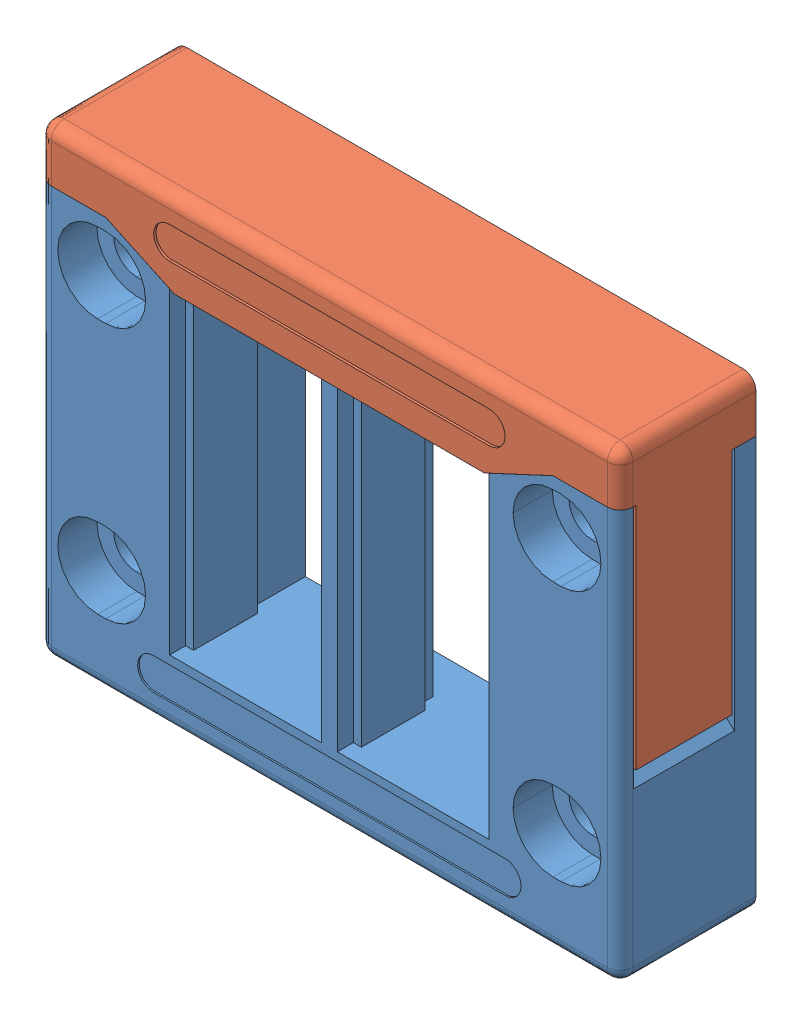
SolidWorks assembly 42434.SLDASM, configuration Default (file format 8000). Lengths in mm.
Overall size (72.8 58 17).
2 component instances, 2 part files, 0 mates.
Components (placement in the parent):
- 42434_01-1: 42434_01.SLDPRT [Default] at origin size (72.8 51.5 17)
- 42434_02-1: 42434_02.SLDPRT [Default] at origin size (72.8 35.2 17)
